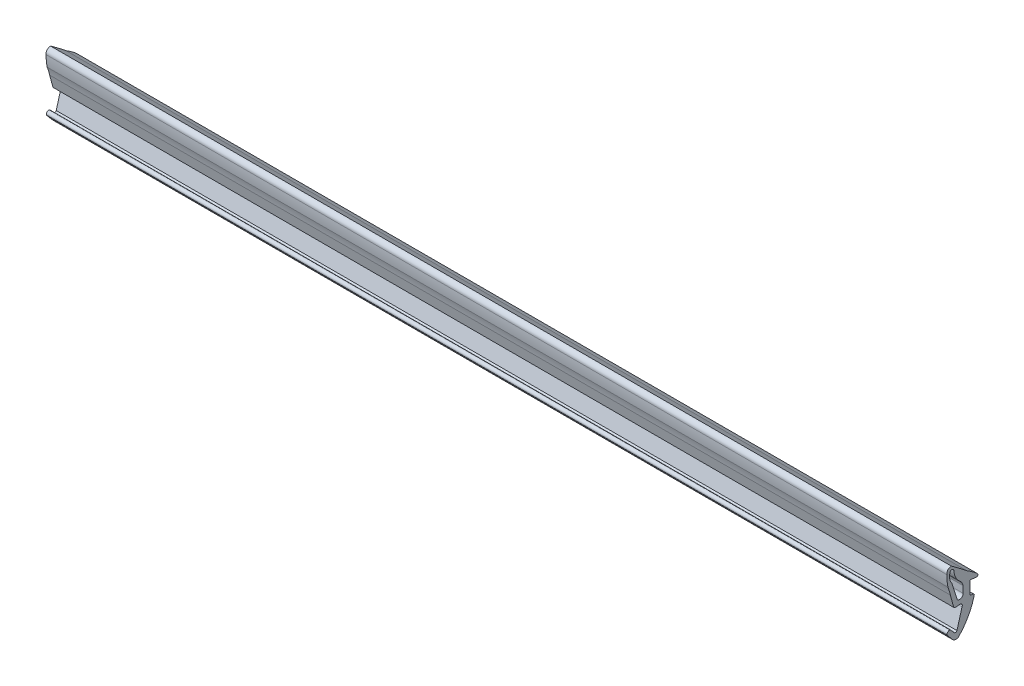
ISO-10303-21;
HEADER;
FILE_DESCRIPTION(('STEP AP214'),'2;1');
FILE_NAME('part.step','',(''),(''),'','','');
FILE_SCHEMA(('AUTOMOTIVE_DESIGN { 1 0 10303 214 1 1 1 1 }'));
ENDSEC;
DATA;
#1=APPLICATION_CONTEXT('core data for automotive mechanical design processes');
#2=APPLICATION_PROTOCOL_DEFINITION('international standard','automotive_design',2000,#1);
#3=PRODUCT_CONTEXT('',#1,'mechanical');
#4=PRODUCT('Part','Part','',(#3));
#5=PRODUCT_RELATED_PRODUCT_CATEGORY('part','',(#4));
#6=PRODUCT_DEFINITION_FORMATION('','',#4);
#7=PRODUCT_DEFINITION_CONTEXT('part definition',#1,'design');
#8=PRODUCT_DEFINITION('design','',#6,#7);
#9=PRODUCT_DEFINITION_SHAPE('','',#8);
#10=(LENGTH_UNIT() NAMED_UNIT(*) SI_UNIT(.MILLI.,.METRE.));
#11=(NAMED_UNIT(*) PLANE_ANGLE_UNIT() SI_UNIT($,.RADIAN.));
#12=(NAMED_UNIT(*) SI_UNIT($,.STERADIAN.) SOLID_ANGLE_UNIT());
#13=UNCERTAINTY_MEASURE_WITH_UNIT(LENGTH_MEASURE(1.E-05),#10,'distance_accuracy_value','');
#14=(GEOMETRIC_REPRESENTATION_CONTEXT(3) GLOBAL_UNCERTAINTY_ASSIGNED_CONTEXT((#13)) GLOBAL_UNIT_ASSIGNED_CONTEXT((#10,
#11,#12)) REPRESENTATION_CONTEXT('',''));
#15=CARTESIAN_POINT('',(0.,0.,0.));
#16=DIRECTION('',(0.,0.,1.));
#17=DIRECTION('',(1.,0.,0.));
#18=AXIS2_PLACEMENT_3D('',#15,#16,#17);
#19=CARTESIAN_POINT('',(200.,-53.1995045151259,45.855950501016));
#20=DIRECTION('',(-1.,0.,0.));
#21=DIRECTION('',(0.,0.,1.));
#22=AXIS2_PLACEMENT_3D('',#19,#20,#21);
#23=CYLINDRICAL_SURFACE('',#22,74.8320819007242);
#24=CARTESIAN_POINT('',(0.,-53.1995045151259,45.855950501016));
#25=DIRECTION('',(1.,0.,0.));
#26=DIRECTION('',(0.,0.,-1.));
#27=AXIS2_PLACEMENT_3D('',#24,#25,#26);
#28=CIRCLE('',#27,74.8320819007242);
#29=CARTESIAN_POINT('',(0.,5.13012386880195,-1.02149539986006));
#30=VERTEX_POINT('',#29);
#31=CARTESIAN_POINT('',(0.,7.75606842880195,2.44790276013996));
#32=VERTEX_POINT('',#31);
#33=EDGE_CURVE('E412',#30,#32,#28,.T.);
#34=ORIENTED_EDGE('',*,*,#33,.T.);
#35=DIRECTION('',(-1.,0.,0.));
#36=VECTOR('',#35,1.);
#37=CARTESIAN_POINT('',(200.,7.75606842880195,2.44790276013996));
#38=LINE('',#37,#36);
#39=CARTESIAN_POINT('',(200.,7.75606842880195,2.44790276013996));
#40=VERTEX_POINT('',#39);
#41=EDGE_CURVE('E12',#40,#32,#38,.T.);
#42=ORIENTED_EDGE('',*,*,#41,.F.);
#43=CARTESIAN_POINT('',(200.,-53.1995045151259,45.855950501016));
#44=DIRECTION('',(1.,0.,0.));
#45=DIRECTION('',(0.,0.,-1.));
#46=AXIS2_PLACEMENT_3D('',#43,#44,#45);
#47=CIRCLE('',#46,74.8320819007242);
#48=CARTESIAN_POINT('',(200.,5.13012386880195,-1.02149539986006));
#49=VERTEX_POINT('',#48);
#50=EDGE_CURVE('E637',#49,#40,#47,.T.);
#51=ORIENTED_EDGE('',*,*,#50,.F.);
#52=DIRECTION('',(-1.,0.,0.));
#53=VECTOR('',#52,1.);
#54=CARTESIAN_POINT('',(200.,5.13012386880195,-1.02149539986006));
#55=LINE('',#54,#53);
#56=EDGE_CURVE('E483',#49,#30,#55,.T.);
#57=ORIENTED_EDGE('',*,*,#56,.T.);
#58=EDGE_LOOP('',(#34,#42,#51,#57));
#59=FACE_BOUND('',#58,.T.);
#60=ADVANCED_FACE('F121',(#59),#23,.T.);
#61=CARTESIAN_POINT('',(200.,6.75630640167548,2.46971709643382));
#62=DIRECTION('',(-1.,0.,0.));
#63=DIRECTION('',(0.,0.,1.));
#64=AXIS2_PLACEMENT_3D('',#61,#62,#63);
#65=CYLINDRICAL_SURFACE('',#64,0.999999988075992);
#66=CARTESIAN_POINT('',(0.,6.75630640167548,2.46971709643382));
#67=DIRECTION('',(1.,0.,0.));
#68=DIRECTION('',(0.,0.,-1.));
#69=AXIS2_PLACEMENT_3D('',#66,#67,#68);
#70=CIRCLE('',#69,0.999999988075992);
#71=CARTESIAN_POINT('',(0.,6.61567283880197,3.45977880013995));
#72=VERTEX_POINT('',#71);
#73=EDGE_CURVE('E416',#32,#72,#70,.T.);
#74=ORIENTED_EDGE('',*,*,#73,.T.);
#75=DIRECTION('',(-1.,0.,0.));
#76=VECTOR('',#75,1.);
#77=CARTESIAN_POINT('',(200.,6.61567283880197,3.45977880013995));
#78=LINE('',#77,#76);
#79=CARTESIAN_POINT('',(200.,6.61567283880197,3.45977880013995));
#80=VERTEX_POINT('',#79);
#81=EDGE_CURVE('E132',#80,#72,#78,.T.);
#82=ORIENTED_EDGE('',*,*,#81,.F.);
#83=CARTESIAN_POINT('',(200.,6.75630640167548,2.46971709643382));
#84=DIRECTION('',(1.,0.,0.));
#85=DIRECTION('',(0.,0.,-1.));
#86=AXIS2_PLACEMENT_3D('',#83,#84,#85);
#87=CIRCLE('',#86,0.999999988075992);
#88=EDGE_CURVE('E640',#40,#80,#87,.T.);
#89=ORIENTED_EDGE('',*,*,#88,.F.);
#90=ORIENTED_EDGE('',*,*,#41,.T.);
#91=EDGE_LOOP('',(#74,#82,#89,#90));
#92=FACE_BOUND('',#91,.T.);
#93=ADVANCED_FACE('F727',(#92),#65,.T.);
#94=CARTESIAN_POINT('',(200.,6.71107271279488,-10.484433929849));
#95=DIRECTION('',(-1.,0.,0.));
#96=DIRECTION('',(0.,0.,1.));
#97=AXIS2_PLACEMENT_3D('',#94,#95,#96);
#98=CYLINDRICAL_SURFACE('',#97,13.9445390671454);
#99=CARTESIAN_POINT('',(0.,6.71107271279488,-10.484433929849));
#100=DIRECTION('',(1.,0.,0.));
#101=DIRECTION('',(0.,0.,-1.));
#102=AXIS2_PLACEMENT_3D('',#99,#100,#101);
#103=CIRCLE('',#102,13.9445390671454);
#104=CARTESIAN_POINT('',(0.,4.08842088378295,3.21125397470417));
#105=VERTEX_POINT('',#104);
#106=EDGE_CURVE('E419',#72,#105,#103,.T.);
#107=ORIENTED_EDGE('',*,*,#106,.T.);
#108=DIRECTION('',(-1.,0.,0.));
#109=VECTOR('',#108,1.);
#110=CARTESIAN_POINT('',(200.,4.08842088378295,3.21125397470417));
#111=LINE('',#110,#109);
#112=CARTESIAN_POINT('',(200.,4.08842088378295,3.21125397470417));
#113=VERTEX_POINT('',#112);
#114=EDGE_CURVE('E558',#113,#105,#111,.T.);
#115=ORIENTED_EDGE('',*,*,#114,.F.);
#116=CARTESIAN_POINT('',(200.,6.71107271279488,-10.484433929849));
#117=DIRECTION('',(1.,0.,0.));
#118=DIRECTION('',(0.,0.,-1.));
#119=AXIS2_PLACEMENT_3D('',#116,#117,#118);
#120=CIRCLE('',#119,13.9445390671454);
#121=EDGE_CURVE('E643',#80,#113,#120,.T.);
#122=ORIENTED_EDGE('',*,*,#121,.F.);
#123=ORIENTED_EDGE('',*,*,#81,.T.);
#124=EDGE_LOOP('',(#107,#115,#122,#123));
#125=FACE_BOUND('',#124,.T.);
#126=ADVANCED_FACE('F732',(#125),#98,.T.);
#127=CARTESIAN_POINT('',(200.,-0.662443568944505,15.6826632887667));
#128=DIRECTION('',(-1.,0.,0.));
#129=DIRECTION('',(0.,0.,1.));
#130=AXIS2_PLACEMENT_3D('',#127,#128,#129);
#131=CYLINDRICAL_SURFACE('',#130,13.3456645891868);
#132=CARTESIAN_POINT('',(0.,-0.662443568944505,15.6826632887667));
#133=DIRECTION('',(-1.,0.,0.));
#134=DIRECTION('',(0.,0.,-1.));
#135=AXIS2_PLACEMENT_3D('',#132,#133,#134);
#136=CIRCLE('',#135,13.3456645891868);
#137=CARTESIAN_POINT('',(0.,2.28806195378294,2.66723857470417));
#138=VERTEX_POINT('',#137);
#139=EDGE_CURVE('E422',#105,#138,#136,.T.);
#140=ORIENTED_EDGE('',*,*,#139,.T.);
#141=DIRECTION('',(-1.,0.,0.));
#142=VECTOR('',#141,1.);
#143=CARTESIAN_POINT('',(200.,2.28806195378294,2.66723857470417));
#144=LINE('',#143,#142);
#145=CARTESIAN_POINT('',(200.,2.28806195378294,2.66723857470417));
#146=VERTEX_POINT('',#145);
#147=EDGE_CURVE('E554',#146,#138,#144,.T.);
#148=ORIENTED_EDGE('',*,*,#147,.F.);
#149=CARTESIAN_POINT('',(200.,-0.662443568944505,15.6826632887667));
#150=DIRECTION('',(-1.,0.,0.));
#151=DIRECTION('',(0.,0.,-1.));
#152=AXIS2_PLACEMENT_3D('',#149,#150,#151);
#153=CIRCLE('',#152,13.3456645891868);
#154=EDGE_CURVE('E646',#113,#146,#153,.T.);
#155=ORIENTED_EDGE('',*,*,#154,.F.);
#156=ORIENTED_EDGE('',*,*,#114,.T.);
#157=EDGE_LOOP('',(#140,#148,#155,#156));
#158=FACE_BOUND('',#157,.T.);
#159=ADVANCED_FACE('F830',(#158),#131,.F.);
#160=CARTESIAN_POINT('',(200.,2.28806195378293,2.66723857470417));
#161=DIRECTION('',(0.,0.263639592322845,-0.964621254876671));
#162=DIRECTION('',(0.,0.964621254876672,0.263639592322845));
#163=AXIS2_PLACEMENT_3D('',#160,#161,#162);
#164=PLANE('',#163);
#165=DIRECTION('',(0.,-0.964621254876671,-0.263639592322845));
#166=VECTOR('',#165,1.);
#167=CARTESIAN_POINT('',(0.,2.28806195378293,2.66723857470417));
#168=LINE('',#167,#166);
#169=CARTESIAN_POINT('',(0.,-0.450346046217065,1.91880724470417));
#170=VERTEX_POINT('',#169);
#171=EDGE_CURVE('E425',#138,#170,#168,.T.);
#172=ORIENTED_EDGE('',*,*,#171,.T.);
#173=DIRECTION('',(-1.,0.,0.));
#174=VECTOR('',#173,1.);
#175=CARTESIAN_POINT('',(200.,-0.450346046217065,1.91880724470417));
#176=LINE('',#175,#174);
#177=CARTESIAN_POINT('',(200.,-0.450346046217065,1.91880724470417));
#178=VERTEX_POINT('',#177);
#179=EDGE_CURVE('E550',#178,#170,#176,.T.);
#180=ORIENTED_EDGE('',*,*,#179,.F.);
#181=DIRECTION('',(0.,-0.964621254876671,-0.263639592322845));
#182=VECTOR('',#181,1.);
#183=CARTESIAN_POINT('',(200.,2.28806195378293,2.66723857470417));
#184=LINE('',#183,#182);
#185=EDGE_CURVE('E649',#146,#178,#184,.T.);
#186=ORIENTED_EDGE('',*,*,#185,.F.);
#187=ORIENTED_EDGE('',*,*,#147,.T.);
#188=EDGE_LOOP('',(#172,#180,#186,#187));
#189=FACE_BOUND('',#188,.T.);
#190=ADVANCED_FACE('F826',(#189),#164,.F.);
#191=CARTESIAN_POINT('',(200.,0.152044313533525,1.39237977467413));
#192=DIRECTION('',(-1.,0.,0.));
#193=DIRECTION('',(0.,0.,1.));
#194=AXIS2_PLACEMENT_3D('',#191,#192,#193);
#195=CYLINDRICAL_SURFACE('',#194,0.800000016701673);
#196=CARTESIAN_POINT('',(0.,0.152044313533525,1.39237977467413));
#197=DIRECTION('',(1.,0.,0.));
#198=DIRECTION('',(0.,0.,-1.));
#199=AXIS2_PLACEMENT_3D('',#196,#197,#198);
#200=CIRCLE('',#199,0.800000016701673);
#201=CARTESIAN_POINT('',(0.,-0.635801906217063,1.25346123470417));
#202=VERTEX_POINT('',#201);
#203=EDGE_CURVE('E428',#170,#202,#200,.T.);
#204=ORIENTED_EDGE('',*,*,#203,.T.);
#205=DIRECTION('',(-1.,0.,0.));
#206=VECTOR('',#205,1.);
#207=CARTESIAN_POINT('',(200.,-0.635801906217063,1.25346123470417));
#208=LINE('',#207,#206);
#209=CARTESIAN_POINT('',(200.,-0.635801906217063,1.25346123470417));
#210=VERTEX_POINT('',#209);
#211=EDGE_CURVE('E546',#210,#202,#208,.T.);
#212=ORIENTED_EDGE('',*,*,#211,.F.);
#213=CARTESIAN_POINT('',(200.,0.152044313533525,1.39237977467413));
#214=DIRECTION('',(1.,0.,0.));
#215=DIRECTION('',(0.,0.,-1.));
#216=AXIS2_PLACEMENT_3D('',#213,#214,#215);
#217=CIRCLE('',#216,0.800000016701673);
#218=EDGE_CURVE('E652',#178,#210,#217,.T.);
#219=ORIENTED_EDGE('',*,*,#218,.F.);
#220=ORIENTED_EDGE('',*,*,#179,.T.);
#221=EDGE_LOOP('',(#204,#212,#219,#220));
#222=FACE_BOUND('',#221,.T.);
#223=ADVANCED_FACE('F822',(#222),#195,.T.);
#224=CARTESIAN_POINT('',(200.,-0.635801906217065,1.25346123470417));
#225=DIRECTION('',(0.,0.98480775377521,0.173648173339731));
#226=DIRECTION('',(0.,-0.173648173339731,0.98480775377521));
#227=AXIS2_PLACEMENT_3D('',#224,#225,#226);
#228=PLANE('',#227);
#229=DIRECTION('',(0.,0.173648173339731,-0.98480775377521));
#230=VECTOR('',#229,1.);
#231=CARTESIAN_POINT('',(0.,-0.635801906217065,1.25346123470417));
#232=LINE('',#231,#230);
#233=CARTESIAN_POINT('',(0.,-0.520941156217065,0.602053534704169));
#234=VERTEX_POINT('',#233);
#235=EDGE_CURVE('E431',#202,#234,#232,.T.);
#236=ORIENTED_EDGE('',*,*,#235,.T.);
#237=DIRECTION('',(-1.,0.,0.));
#238=VECTOR('',#237,1.);
#239=CARTESIAN_POINT('',(200.,-0.520941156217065,0.602053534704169));
#240=LINE('',#239,#238);
#241=CARTESIAN_POINT('',(200.,-0.520941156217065,0.602053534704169));
#242=VERTEX_POINT('',#241);
#243=EDGE_CURVE('E542',#242,#234,#240,.T.);
#244=ORIENTED_EDGE('',*,*,#243,.F.);
#245=DIRECTION('',(0.,0.173648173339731,-0.98480775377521));
#246=VECTOR('',#245,1.);
#247=CARTESIAN_POINT('',(200.,-0.635801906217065,1.25346123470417));
#248=LINE('',#247,#246);
#249=EDGE_CURVE('E655',#210,#242,#248,.T.);
#250=ORIENTED_EDGE('',*,*,#249,.F.);
#251=ORIENTED_EDGE('',*,*,#211,.T.);
#252=EDGE_LOOP('',(#236,#244,#250,#251));
#253=FACE_BOUND('',#252,.T.);
#254=ADVANCED_FACE('F818',(#253),#228,.F.);
#255=CARTESIAN_POINT('',(200.,-1.01334503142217,0.515229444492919));
#256=DIRECTION('',(-1.,0.,0.));
#257=DIRECTION('',(0.,0.,1.));
#258=AXIS2_PLACEMENT_3D('',#255,#256,#257);
#259=CYLINDRICAL_SURFACE('',#258,0.49999999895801);
#260=CARTESIAN_POINT('',(0.,-1.01334503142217,0.515229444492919));
#261=DIRECTION('',(-1.,0.,0.));
#262=DIRECTION('',(0.,0.,-1.));
#263=AXIS2_PLACEMENT_3D('',#260,#261,#262);
#264=CIRCLE('',#263,0.49999999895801);
#265=CARTESIAN_POINT('',(0.,-1.25574984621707,0.0779195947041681));
#266=VERTEX_POINT('',#265);
#267=EDGE_CURVE('E434',#234,#266,#264,.T.);
#268=ORIENTED_EDGE('',*,*,#267,.T.);
#269=DIRECTION('',(-1.,0.,0.));
#270=VECTOR('',#269,1.);
#271=CARTESIAN_POINT('',(200.,-1.25574984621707,0.0779195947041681));
#272=LINE('',#271,#270);
#273=CARTESIAN_POINT('',(200.,-1.25574984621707,0.0779195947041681));
#274=VERTEX_POINT('',#273);
#275=EDGE_CURVE('E538',#274,#266,#272,.T.);
#276=ORIENTED_EDGE('',*,*,#275,.F.);
#277=CARTESIAN_POINT('',(200.,-1.01334503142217,0.515229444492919));
#278=DIRECTION('',(-1.,0.,0.));
#279=DIRECTION('',(0.,0.,-1.));
#280=AXIS2_PLACEMENT_3D('',#277,#278,#279);
#281=CIRCLE('',#280,0.49999999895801);
#282=EDGE_CURVE('E658',#242,#274,#281,.T.);
#283=ORIENTED_EDGE('',*,*,#282,.F.);
#284=ORIENTED_EDGE('',*,*,#243,.T.);
#285=EDGE_LOOP('',(#268,#276,#283,#284));
#286=FACE_BOUND('',#285,.T.);
#287=ADVANCED_FACE('F814',(#286),#259,.F.);
#288=CARTESIAN_POINT('',(200.,-1.25574984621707,0.077919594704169));
#289=DIRECTION('',(0.,-0.270918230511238,-0.962602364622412));
#290=DIRECTION('',(0.,0.962602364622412,-0.270918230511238));
#291=AXIS2_PLACEMENT_3D('',#288,#289,#290);
#292=PLANE('',#291);
#293=DIRECTION('',(0.,-0.962602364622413,0.270918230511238));
#294=VECTOR('',#293,1.);
#295=CARTESIAN_POINT('',(0.,-1.25574984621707,0.077919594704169));
#296=LINE('',#295,#294);
#297=CARTESIAN_POINT('',(0.,-5.25837802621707,1.20443349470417));
#298=VERTEX_POINT('',#297);
#299=EDGE_CURVE('E437',#266,#298,#296,.T.);
#300=ORIENTED_EDGE('',*,*,#299,.T.);
#301=DIRECTION('',(-1.,0.,0.));
#302=VECTOR('',#301,1.);
#303=CARTESIAN_POINT('',(200.,-5.25837802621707,1.20443349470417));
#304=LINE('',#303,#302);
#305=CARTESIAN_POINT('',(200.,-5.25837802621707,1.20443349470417));
#306=VERTEX_POINT('',#305);
#307=EDGE_CURVE('E534',#306,#298,#304,.T.);
#308=ORIENTED_EDGE('',*,*,#307,.F.);
#309=DIRECTION('',(0.,-0.962602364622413,0.270918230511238));
#310=VECTOR('',#309,1.);
#311=CARTESIAN_POINT('',(200.,-1.25574984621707,0.077919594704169));
#312=LINE('',#311,#310);
#313=EDGE_CURVE('E661',#274,#306,#312,.T.);
#314=ORIENTED_EDGE('',*,*,#313,.F.);
#315=ORIENTED_EDGE('',*,*,#275,.T.);
#316=EDGE_LOOP('',(#300,#308,#314,#315));
#317=FACE_BOUND('',#316,.T.);
#318=ADVANCED_FACE('F810',(#317),#292,.F.);
#319=CARTESIAN_POINT('',(200.,-5.06445419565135,1.55428137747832));
#320=DIRECTION('',(-1.,0.,0.));
#321=DIRECTION('',(0.,0.,1.));
#322=AXIS2_PLACEMENT_3D('',#319,#320,#321);
#323=CYLINDRICAL_SURFACE('',#322,0.39999999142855);
#324=CARTESIAN_POINT('',(0.,-5.06445419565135,1.55428137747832));
#325=DIRECTION('',(-1.,0.,0.));
#326=DIRECTION('',(0.,0.,-1.));
#327=AXIS2_PLACEMENT_3D('',#324,#325,#326);
#328=CIRCLE('',#327,0.39999999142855);
#329=CARTESIAN_POINT('',(0.,-5.32156922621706,1.86069915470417));
#330=VERTEX_POINT('',#329);
#331=EDGE_CURVE('E440',#298,#330,#328,.T.);
#332=ORIENTED_EDGE('',*,*,#331,.T.);
#333=DIRECTION('',(-1.,0.,0.));
#334=VECTOR('',#333,1.);
#335=CARTESIAN_POINT('',(200.,-5.32156922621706,1.86069915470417));
#336=LINE('',#335,#334);
#337=CARTESIAN_POINT('',(200.,-5.32156922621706,1.86069915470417));
#338=VERTEX_POINT('',#337);
#339=EDGE_CURVE('E530',#338,#330,#336,.T.);
#340=ORIENTED_EDGE('',*,*,#339,.F.);
#341=CARTESIAN_POINT('',(200.,-5.06445419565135,1.55428137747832));
#342=DIRECTION('',(-1.,0.,0.));
#343=DIRECTION('',(0.,0.,-1.));
#344=AXIS2_PLACEMENT_3D('',#341,#342,#343);
#345=CIRCLE('',#344,0.39999999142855);
#346=EDGE_CURVE('E664',#306,#338,#345,.T.);
#347=ORIENTED_EDGE('',*,*,#346,.F.);
#348=ORIENTED_EDGE('',*,*,#307,.T.);
#349=EDGE_LOOP('',(#332,#340,#347,#348));
#350=FACE_BOUND('',#349,.T.);
#351=ADVANCED_FACE('F806',(#350),#323,.F.);
#352=CARTESIAN_POINT('',(200.,-5.32156922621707,1.86069915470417));
#353=DIRECTION('',(0.,-0.642787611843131,0.766044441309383));
#354=DIRECTION('',(0.,-0.766044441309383,-0.642787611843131));
#355=AXIS2_PLACEMENT_3D('',#352,#353,#354);
#356=PLANE('',#355);
#357=DIRECTION('',(0.,0.766044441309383,0.642787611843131));
#358=VECTOR('',#357,1.);
#359=CARTESIAN_POINT('',(0.,-5.32156922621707,1.86069915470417));
#360=LINE('',#359,#358);
#361=CARTESIAN_POINT('',(0.,-4.54451063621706,2.51272873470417));
#362=VERTEX_POINT('',#361);
#363=EDGE_CURVE('E443',#330,#362,#360,.T.);
#364=ORIENTED_EDGE('',*,*,#363,.T.);
#365=DIRECTION('',(-1.,0.,0.));
#366=VECTOR('',#365,1.);
#367=CARTESIAN_POINT('',(200.,-4.54451063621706,2.51272873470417));
#368=LINE('',#367,#366);
#369=CARTESIAN_POINT('',(200.,-4.54451063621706,2.51272873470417));
#370=VERTEX_POINT('',#369);
#371=EDGE_CURVE('E526',#370,#362,#368,.T.);
#372=ORIENTED_EDGE('',*,*,#371,.F.);
#373=DIRECTION('',(0.,0.766044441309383,0.642787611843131));
#374=VECTOR('',#373,1.);
#375=CARTESIAN_POINT('',(200.,-5.32156922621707,1.86069915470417));
#376=LINE('',#375,#374);
#377=EDGE_CURVE('E667',#338,#370,#376,.T.);
#378=ORIENTED_EDGE('',*,*,#377,.F.);
#379=ORIENTED_EDGE('',*,*,#339,.T.);
#380=EDGE_LOOP('',(#364,#372,#378,#379));
#381=FACE_BOUND('',#380,.T.);
#382=ADVANCED_FACE('F802',(#381),#356,.F.);
#383=CARTESIAN_POINT('',(200.,-4.86590444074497,2.89575095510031));
#384=DIRECTION('',(-1.,0.,0.));
#385=DIRECTION('',(0.,0.,1.));
#386=AXIS2_PLACEMENT_3D('',#383,#384,#385);
#387=CYLINDRICAL_SURFACE('',#386,0.499999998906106);
#388=CARTESIAN_POINT('',(0.,-4.86590444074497,2.89575095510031));
#389=DIRECTION('',(1.,0.,0.));
#390=DIRECTION('',(0.,0.,-1.));
#391=AXIS2_PLACEMENT_3D('',#388,#389,#390);
#392=CIRCLE('',#391,0.499999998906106);
#393=CARTESIAN_POINT('',(0.,-5.18729824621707,3.27877317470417));
#394=VERTEX_POINT('',#393);
#395=EDGE_CURVE('E446',#362,#394,#392,.T.);
#396=ORIENTED_EDGE('',*,*,#395,.T.);
#397=DIRECTION('',(-1.,0.,0.));
#398=VECTOR('',#397,1.);
#399=CARTESIAN_POINT('',(200.,-5.18729824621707,3.27877317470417));
#400=LINE('',#399,#398);
#401=CARTESIAN_POINT('',(200.,-5.18729824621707,3.27877317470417));
#402=VERTEX_POINT('',#401);
#403=EDGE_CURVE('E522',#402,#394,#400,.T.);
#404=ORIENTED_EDGE('',*,*,#403,.F.);
#405=CARTESIAN_POINT('',(200.,-4.86590444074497,2.89575095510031));
#406=DIRECTION('',(1.,0.,0.));
#407=DIRECTION('',(0.,0.,-1.));
#408=AXIS2_PLACEMENT_3D('',#405,#406,#407);
#409=CIRCLE('',#408,0.499999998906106);
#410=EDGE_CURVE('E670',#370,#402,#409,.T.);
#411=ORIENTED_EDGE('',*,*,#410,.F.);
#412=ORIENTED_EDGE('',*,*,#371,.T.);
#413=EDGE_LOOP('',(#396,#404,#411,#412));
#414=FACE_BOUND('',#413,.T.);
#415=ADVANCED_FACE('F798',(#414),#387,.T.);
#416=CARTESIAN_POINT('',(200.,-5.18729824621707,3.27877317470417));
#417=DIRECTION('',(0.,0.64278761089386,-0.766044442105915));
#418=DIRECTION('',(0.,0.766044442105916,0.64278761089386));
#419=AXIS2_PLACEMENT_3D('',#416,#417,#418);
#420=PLANE('',#419);
#421=DIRECTION('',(0.,-0.766044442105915,-0.64278761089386));
#422=VECTOR('',#421,1.);
#423=CARTESIAN_POINT('',(0.,-5.18729824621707,3.27877317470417));
#424=LINE('',#423,#422);
#425=CARTESIAN_POINT('',(0.,-6.48135757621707,2.19292846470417));
#426=VERTEX_POINT('',#425);
#427=EDGE_CURVE('E449',#394,#426,#424,.T.);
#428=ORIENTED_EDGE('',*,*,#427,.T.);
#429=DIRECTION('',(-1.,0.,0.));
#430=VECTOR('',#429,1.);
#431=CARTESIAN_POINT('',(200.,-6.48135757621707,2.19292846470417));
#432=LINE('',#431,#430);
#433=CARTESIAN_POINT('',(200.,-6.48135757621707,2.19292846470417));
#434=VERTEX_POINT('',#433);
#435=EDGE_CURVE('E518',#434,#426,#432,.T.);
#436=ORIENTED_EDGE('',*,*,#435,.F.);
#437=DIRECTION('',(0.,-0.766044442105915,-0.64278761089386));
#438=VECTOR('',#437,1.);
#439=CARTESIAN_POINT('',(200.,-5.18729824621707,3.27877317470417));
#440=LINE('',#439,#438);
#441=EDGE_CURVE('E673',#402,#434,#440,.T.);
#442=ORIENTED_EDGE('',*,*,#441,.F.);
#443=ORIENTED_EDGE('',*,*,#403,.T.);
#444=EDGE_LOOP('',(#428,#436,#442,#443));
#445=FACE_BOUND('',#444,.T.);
#446=ADVANCED_FACE('F794',(#445),#420,.F.);
#447=CARTESIAN_POINT('',(200.,-5.83856996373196,1.42688402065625));
#448=DIRECTION('',(-1.,0.,0.));
#449=DIRECTION('',(0.,0.,1.));
#450=AXIS2_PLACEMENT_3D('',#447,#448,#449);
#451=CYLINDRICAL_SURFACE('',#450,1.00000000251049);
#452=CARTESIAN_POINT('',(0.,-5.83856996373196,1.42688402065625));
#453=DIRECTION('',(1.,0.,0.));
#454=DIRECTION('',(0.,0.,-1.));
#455=AXIS2_PLACEMENT_3D('',#452,#453,#454);
#456=CIRCLE('',#455,1.00000000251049);
#457=CARTESIAN_POINT('',(0.,-6.62853705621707,0.813734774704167));
#458=VERTEX_POINT('',#457);
#459=EDGE_CURVE('E452',#426,#458,#456,.T.);
#460=ORIENTED_EDGE('',*,*,#459,.T.);
#461=DIRECTION('',(-1.,0.,0.));
#462=VECTOR('',#461,1.);
#463=CARTESIAN_POINT('',(200.,-6.62853705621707,0.813734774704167));
#464=LINE('',#463,#462);
#465=CARTESIAN_POINT('',(200.,-6.62853705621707,0.813734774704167));
#466=VERTEX_POINT('',#465);
#467=EDGE_CURVE('E514',#466,#458,#464,.T.);
#468=ORIENTED_EDGE('',*,*,#467,.F.);
#469=CARTESIAN_POINT('',(200.,-5.83856996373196,1.42688402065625));
#470=DIRECTION('',(1.,0.,0.));
#471=DIRECTION('',(0.,0.,-1.));
#472=AXIS2_PLACEMENT_3D('',#469,#470,#471);
#473=CIRCLE('',#472,1.00000000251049);
#474=EDGE_CURVE('E676',#434,#466,#473,.T.);
#475=ORIENTED_EDGE('',*,*,#474,.F.);
#476=ORIENTED_EDGE('',*,*,#435,.T.);
#477=EDGE_LOOP('',(#460,#468,#475,#476));
#478=FACE_BOUND('',#477,.T.);
#479=ADVANCED_FACE('F790',(#478),#451,.T.);
#480=CARTESIAN_POINT('',(200.,2.93502423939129,10.7488894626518));
#481=DIRECTION('',(-1.,0.,0.));
#482=DIRECTION('',(0.,0.,1.));
#483=AXIS2_PLACEMENT_3D('',#480,#481,#482);
#484=CYLINDRICAL_SURFACE('',#483,13.7901777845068);
#485=CARTESIAN_POINT('',(0.,2.93502423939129,10.7488894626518));
#486=DIRECTION('',(1.,0.,0.));
#487=DIRECTION('',(0.,0.,-1.));
#488=AXIS2_PLACEMENT_3D('',#485,#486,#487);
#489=CIRCLE('',#488,13.7901777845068);
#490=CARTESIAN_POINT('',(0.,-0.449299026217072,-2.61955694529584));
#491=VERTEX_POINT('',#490);
#492=EDGE_CURVE('E455',#458,#491,#489,.T.);
#493=ORIENTED_EDGE('',*,*,#492,.T.);
#494=DIRECTION('',(-1.,0.,0.));
#495=VECTOR('',#494,1.);
#496=CARTESIAN_POINT('',(200.,-0.449299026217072,-2.61955694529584));
#497=LINE('',#496,#495);
#498=CARTESIAN_POINT('',(200.,-0.449299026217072,-2.61955694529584));
#499=VERTEX_POINT('',#498);
#500=EDGE_CURVE('E510',#499,#491,#497,.T.);
#501=ORIENTED_EDGE('',*,*,#500,.F.);
#502=CARTESIAN_POINT('',(200.,2.93502423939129,10.7488894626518));
#503=DIRECTION('',(1.,0.,0.));
#504=DIRECTION('',(0.,0.,-1.));
#505=AXIS2_PLACEMENT_3D('',#502,#503,#504);
#506=CIRCLE('',#505,13.7901777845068);
#507=EDGE_CURVE('E679',#466,#499,#506,.T.);
#508=ORIENTED_EDGE('',*,*,#507,.F.);
#509=ORIENTED_EDGE('',*,*,#467,.T.);
#510=EDGE_LOOP('',(#493,#501,#508,#509));
#511=FACE_BOUND('',#510,.T.);
#512=ADVANCED_FACE('F786',(#511),#484,.T.);
#513=CARTESIAN_POINT('',(200.,-0.337791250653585,-2.34105018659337));
#514=DIRECTION('',(-1.,0.,0.));
#515=DIRECTION('',(0.,0.,1.));
#516=AXIS2_PLACEMENT_3D('',#513,#514,#515);
#517=CYLINDRICAL_SURFACE('',#516,0.29999999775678);
#518=CARTESIAN_POINT('',(0.,-0.337791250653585,-2.34105018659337));
#519=DIRECTION('',(1.,0.,0.));
#520=DIRECTION('',(0.,0.,-1.));
#521=AXIS2_PLACEMENT_3D('',#518,#519,#520);
#522=CIRCLE('',#521,0.29999999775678);
#523=CARTESIAN_POINT('',(0.,-0.0423489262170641,-2.39314463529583));
#524=VERTEX_POINT('',#523);
#525=EDGE_CURVE('E458',#491,#524,#522,.T.);
#526=ORIENTED_EDGE('',*,*,#525,.T.);
#527=DIRECTION('',(-1.,0.,0.));
#528=VECTOR('',#527,1.);
#529=CARTESIAN_POINT('',(200.,-0.0423489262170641,-2.39314463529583));
#530=LINE('',#529,#528);
#531=CARTESIAN_POINT('',(200.,-0.0423489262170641,-2.39314463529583));
#532=VERTEX_POINT('',#531);
#533=EDGE_CURVE('E506',#532,#524,#530,.T.);
#534=ORIENTED_EDGE('',*,*,#533,.F.);
#535=CARTESIAN_POINT('',(200.,-0.337791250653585,-2.34105018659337));
#536=DIRECTION('',(1.,0.,0.));
#537=DIRECTION('',(0.,0.,-1.));
#538=AXIS2_PLACEMENT_3D('',#535,#536,#537);
#539=CIRCLE('',#538,0.29999999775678);
#540=EDGE_CURVE('E682',#499,#532,#539,.T.);
#541=ORIENTED_EDGE('',*,*,#540,.F.);
#542=ORIENTED_EDGE('',*,*,#500,.T.);
#543=EDGE_LOOP('',(#526,#534,#541,#542));
#544=FACE_BOUND('',#543,.T.);
#545=ADVANCED_FACE('F782',(#544),#517,.T.);
#546=CARTESIAN_POINT('',(200.,-0.0423489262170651,-2.39314463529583));
#547=DIRECTION('',(0.,-0.984807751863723,0.173648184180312));
#548=DIRECTION('',(0.,-0.173648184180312,-0.984807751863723));
#549=AXIS2_PLACEMENT_3D('',#546,#547,#548);
#550=PLANE('',#549);
#551=DIRECTION('',(0.,0.173648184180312,0.984807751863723));
#552=VECTOR('',#551,1.);
#553=CARTESIAN_POINT('',(0.,-0.0423489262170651,-2.39314463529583));
#554=LINE('',#553,#552);
#555=CARTESIAN_POINT('',(0.,0.041498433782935,-1.91762264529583));
#556=VERTEX_POINT('',#555);
#557=EDGE_CURVE('E461',#524,#556,#554,.T.);
#558=ORIENTED_EDGE('',*,*,#557,.T.);
#559=DIRECTION('',(-1.,0.,0.));
#560=VECTOR('',#559,1.);
#561=CARTESIAN_POINT('',(200.,0.041498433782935,-1.91762264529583));
#562=LINE('',#561,#560);
#563=CARTESIAN_POINT('',(200.,0.041498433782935,-1.91762264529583));
#564=VERTEX_POINT('',#563);
#565=EDGE_CURVE('E502',#564,#556,#562,.T.);
#566=ORIENTED_EDGE('',*,*,#565,.F.);
#567=DIRECTION('',(0.,0.173648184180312,0.984807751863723));
#568=VECTOR('',#567,1.);
#569=CARTESIAN_POINT('',(200.,-0.0423489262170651,-2.39314463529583));
#570=LINE('',#569,#568);
#571=EDGE_CURVE('E685',#532,#564,#570,.T.);
#572=ORIENTED_EDGE('',*,*,#571,.F.);
#573=ORIENTED_EDGE('',*,*,#533,.T.);
#574=EDGE_LOOP('',(#558,#566,#572,#573));
#575=FACE_BOUND('',#574,.T.);
#576=ADVANCED_FACE('F778',(#575),#550,.F.);
#577=CARTESIAN_POINT('',(200.,0.336940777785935,-1.96971711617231));
#578=DIRECTION('',(-1.,0.,0.));
#579=DIRECTION('',(0.,0.,1.));
#580=AXIS2_PLACEMENT_3D('',#577,#578,#579);
#581=CYLINDRICAL_SURFACE('',#580,0.30000002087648);
#582=CARTESIAN_POINT('',(0.,0.336940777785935,-1.96971711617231));
#583=DIRECTION('',(-1.,0.,0.));
#584=DIRECTION('',(0.,0.,-1.));
#585=AXIS2_PLACEMENT_3D('',#582,#583,#584);
#586=CIRCLE('',#585,0.30000002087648);
#587=CARTESIAN_POINT('',(0.,0.336940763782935,-1.66971709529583));
#588=VERTEX_POINT('',#587);
#589=EDGE_CURVE('E464',#556,#588,#586,.T.);
#590=ORIENTED_EDGE('',*,*,#589,.T.);
#591=DIRECTION('',(-1.,0.,0.));
#592=VECTOR('',#591,1.);
#593=CARTESIAN_POINT('',(200.,0.336940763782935,-1.66971709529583));
#594=LINE('',#593,#592);
#595=CARTESIAN_POINT('',(200.,0.336940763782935,-1.66971709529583));
#596=VERTEX_POINT('',#595);
#597=EDGE_CURVE('E498',#596,#588,#594,.T.);
#598=ORIENTED_EDGE('',*,*,#597,.F.);
#599=CARTESIAN_POINT('',(200.,0.336940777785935,-1.96971711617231));
#600=DIRECTION('',(-1.,0.,0.));
#601=DIRECTION('',(0.,0.,-1.));
#602=AXIS2_PLACEMENT_3D('',#599,#600,#601);
#603=CIRCLE('',#602,0.30000002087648);
#604=EDGE_CURVE('E688',#564,#596,#603,.T.);
#605=ORIENTED_EDGE('',*,*,#604,.F.);
#606=ORIENTED_EDGE('',*,*,#565,.T.);
#607=EDGE_LOOP('',(#590,#598,#605,#606));
#608=FACE_BOUND('',#607,.T.);
#609=ADVANCED_FACE('F774',(#608),#581,.F.);
#610=CARTESIAN_POINT('',(200.,0.336940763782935,-1.66971709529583));
#611=DIRECTION('',(0.,0.,1.));
#612=DIRECTION('',(0.,-1.,0.));
#613=AXIS2_PLACEMENT_3D('',#610,#611,#612);
#614=PLANE('',#613);
#615=DIRECTION('',(0.,1.,0.));
#616=VECTOR('',#615,1.);
#617=CARTESIAN_POINT('',(0.,0.336940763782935,-1.66971709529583));
#618=LINE('',#617,#616);
#619=CARTESIAN_POINT('',(0.,2.78662321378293,-1.66971709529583));
#620=VERTEX_POINT('',#619);
#621=EDGE_CURVE('E467',#588,#620,#618,.T.);
#622=ORIENTED_EDGE('',*,*,#621,.T.);
#623=DIRECTION('',(-1.,0.,0.));
#624=VECTOR('',#623,1.);
#625=CARTESIAN_POINT('',(200.,2.78662321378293,-1.66971709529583));
#626=LINE('',#625,#624);
#627=CARTESIAN_POINT('',(200.,2.78662321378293,-1.66971709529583));
#628=VERTEX_POINT('',#627);
#629=EDGE_CURVE('E494',#628,#620,#626,.T.);
#630=ORIENTED_EDGE('',*,*,#629,.F.);
#631=DIRECTION('',(0.,1.,0.));
#632=VECTOR('',#631,1.);
#633=CARTESIAN_POINT('',(200.,0.336940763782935,-1.66971709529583));
#634=LINE('',#633,#632);
#635=EDGE_CURVE('E691',#596,#628,#634,.T.);
#636=ORIENTED_EDGE('',*,*,#635,.F.);
#637=ORIENTED_EDGE('',*,*,#597,.T.);
#638=EDGE_LOOP('',(#622,#630,#636,#637));
#639=FACE_BOUND('',#638,.T.);
#640=ADVANCED_FACE('F771',(#639),#614,.F.);
#641=CARTESIAN_POINT('',(200.,2.78662321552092,-1.86971708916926));
#642=DIRECTION('',(-1.,0.,0.));
#643=DIRECTION('',(0.,0.,1.));
#644=AXIS2_PLACEMENT_3D('',#641,#642,#643);
#645=CYLINDRICAL_SURFACE('',#644,0.199999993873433);
#646=CARTESIAN_POINT('',(0.,2.78662321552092,-1.86971708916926));
#647=DIRECTION('',(-1.,0.,0.));
#648=DIRECTION('',(0.,0.,-1.));
#649=AXIS2_PLACEMENT_3D('',#646,#647,#648);
#650=CIRCLE('',#649,0.199999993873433);
#651=CARTESIAN_POINT('',(0.,2.98586214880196,-1.88714823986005));
#652=VERTEX_POINT('',#651);
#653=EDGE_CURVE('E470',#620,#652,#650,.T.);
#654=ORIENTED_EDGE('',*,*,#653,.T.);
#655=DIRECTION('',(-1.,0.,0.));
#656=VECTOR('',#655,1.);
#657=CARTESIAN_POINT('',(200.,2.98586214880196,-1.88714823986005));
#658=LINE('',#657,#656);
#659=CARTESIAN_POINT('',(200.,2.98586214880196,-1.88714823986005));
#660=VERTEX_POINT('',#659);
#661=EDGE_CURVE('E490',#660,#652,#658,.T.);
#662=ORIENTED_EDGE('',*,*,#661,.F.);
#663=CARTESIAN_POINT('',(200.,2.78662321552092,-1.86971708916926));
#664=DIRECTION('',(-1.,0.,0.));
#665=DIRECTION('',(0.,0.,-1.));
#666=AXIS2_PLACEMENT_3D('',#663,#664,#665);
#667=CIRCLE('',#666,0.199999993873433);
#668=EDGE_CURVE('E694',#628,#660,#667,.T.);
#669=ORIENTED_EDGE('',*,*,#668,.F.);
#670=ORIENTED_EDGE('',*,*,#629,.T.);
#671=EDGE_LOOP('',(#654,#662,#669,#670));
#672=FACE_BOUND('',#671,.T.);
#673=ADVANCED_FACE('F702',(#672),#645,.F.);
#674=CARTESIAN_POINT('',(200.,2.98586214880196,-1.88714823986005));
#675=DIRECTION('',(0.,0.996194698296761,-0.0871557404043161));
#676=DIRECTION('',(0.,0.0871557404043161,0.996194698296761));
#677=AXIS2_PLACEMENT_3D('',#674,#675,#676);
#678=PLANE('',#677);
#679=DIRECTION('',(0.,-0.0871557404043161,-0.996194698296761));
#680=VECTOR('',#679,1.);
#681=CARTESIAN_POINT('',(0.,2.98586214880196,-1.88714823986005));
#682=LINE('',#681,#680);
#683=CARTESIAN_POINT('',(0.,2.87593945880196,-3.14357036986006));
#684=VERTEX_POINT('',#683);
#685=EDGE_CURVE('E473',#652,#684,#682,.T.);
#686=ORIENTED_EDGE('',*,*,#685,.T.);
#687=DIRECTION('',(-1.,0.,0.));
#688=VECTOR('',#687,1.);
#689=CARTESIAN_POINT('',(200.,2.87593945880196,-3.14357036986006));
#690=LINE('',#689,#688);
#691=CARTESIAN_POINT('',(200.,2.87593945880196,-3.14357036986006));
#692=VERTEX_POINT('',#691);
#693=EDGE_CURVE('E365',#692,#684,#690,.T.);
#694=ORIENTED_EDGE('',*,*,#693,.F.);
#695=DIRECTION('',(0.,-0.0871557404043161,-0.996194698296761));
#696=VECTOR('',#695,1.);
#697=CARTESIAN_POINT('',(200.,2.98586214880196,-1.88714823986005));
#698=LINE('',#697,#696);
#699=EDGE_CURVE('E354',#660,#692,#698,.T.);
#700=ORIENTED_EDGE('',*,*,#699,.F.);
#701=ORIENTED_EDGE('',*,*,#661,.T.);
#702=EDGE_LOOP('',(#686,#694,#700,#701));
#703=FACE_BOUND('',#702,.T.);
#704=ADVANCED_FACE('F706',(#703),#678,.F.);
#705=CARTESIAN_POINT('',(200.,3.17479786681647,-3.16971709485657));
#706=DIRECTION('',(-1.,0.,0.));
#707=DIRECTION('',(0.,0.,1.));
#708=AXIS2_PLACEMENT_3D('',#705,#706,#707);
#709=CYLINDRICAL_SURFACE('',#708,0.299999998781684);
#710=CARTESIAN_POINT('',(0.,3.17479786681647,-3.16971709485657));
#711=DIRECTION('',(1.,0.,0.));
#712=DIRECTION('',(0.,0.,-1.));
#713=AXIS2_PLACEMENT_3D('',#710,#711,#712);
#714=CIRCLE('',#713,0.299999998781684);
#715=CARTESIAN_POINT('',(0.,3.38692989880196,-3.38184912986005));
#716=VERTEX_POINT('',#715);
#717=EDGE_CURVE('E363',#684,#716,#714,.T.);
#718=ORIENTED_EDGE('',*,*,#717,.T.);
#719=DIRECTION('',(-1.,0.,0.));
#720=VECTOR('',#719,1.);
#721=CARTESIAN_POINT('',(200.,3.38692989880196,-3.38184912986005));
#722=LINE('',#721,#720);
#723=CARTESIAN_POINT('',(200.,3.38692989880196,-3.38184912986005));
#724=VERTEX_POINT('',#723);
#725=EDGE_CURVE('E360',#724,#716,#722,.T.);
#726=ORIENTED_EDGE('',*,*,#725,.F.);
#727=CARTESIAN_POINT('',(200.,3.17479786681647,-3.16971709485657));
#728=DIRECTION('',(1.,0.,0.));
#729=DIRECTION('',(0.,0.,-1.));
#730=AXIS2_PLACEMENT_3D('',#727,#728,#729);
#731=CIRCLE('',#730,0.299999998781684);
#732=EDGE_CURVE('E348',#692,#724,#731,.T.);
#733=ORIENTED_EDGE('',*,*,#732,.F.);
#734=ORIENTED_EDGE('',*,*,#693,.T.);
#735=EDGE_LOOP('',(#718,#726,#733,#734));
#736=FACE_BOUND('',#735,.T.);
#737=ADVANCED_FACE('F361',(#736),#709,.T.);
#738=CARTESIAN_POINT('',(200.,3.38692989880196,-3.38184912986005));
#739=DIRECTION('',(0.,-0.707106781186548,0.707106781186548));
#740=DIRECTION('',(0.,-0.707106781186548,-0.707106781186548));
#741=AXIS2_PLACEMENT_3D('',#738,#739,#740);
#742=PLANE('',#741);
#743=DIRECTION('',(0.,0.707106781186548,0.707106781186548));
#744=VECTOR('',#743,1.);
#745=CARTESIAN_POINT('',(0.,3.38692989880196,-3.38184912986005));
#746=LINE('',#745,#744);
#747=CARTESIAN_POINT('',(0.,3.59588329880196,-3.17289572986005));
#748=VERTEX_POINT('',#747);
#749=EDGE_CURVE('E245',#716,#748,#746,.T.);
#750=ORIENTED_EDGE('',*,*,#749,.T.);
#751=DIRECTION('',(-1.,0.,0.));
#752=VECTOR('',#751,1.);
#753=CARTESIAN_POINT('',(200.,3.59588329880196,-3.17289572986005));
#754=LINE('',#753,#752);
#755=CARTESIAN_POINT('',(200.,3.59588329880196,-3.17289572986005));
#756=VERTEX_POINT('',#755);
#757=EDGE_CURVE('E366',#756,#748,#754,.T.);
#758=ORIENTED_EDGE('',*,*,#757,.F.);
#759=DIRECTION('',(0.,0.707106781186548,0.707106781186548));
#760=VECTOR('',#759,1.);
#761=CARTESIAN_POINT('',(200.,3.38692989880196,-3.38184912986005));
#762=LINE('',#761,#760);
#763=EDGE_CURVE('E352',#724,#756,#762,.T.);
#764=ORIENTED_EDGE('',*,*,#763,.F.);
#765=ORIENTED_EDGE('',*,*,#725,.T.);
#766=EDGE_LOOP('',(#750,#758,#764,#765));
#767=FACE_BOUND('',#766,.T.);
#768=ADVANCED_FACE('F368',(#767),#742,.F.);
#769=CARTESIAN_POINT('',(200.,5.94581349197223,0.348136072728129));
#770=DIRECTION('',(-1.,0.,0.));
#771=DIRECTION('',(0.,0.,1.));
#772=AXIS2_PLACEMENT_3D('',#769,#770,#771);
#773=CYLINDRICAL_SURFACE('',#772,2.51017117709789);
#774=CARTESIAN_POINT('',(0.,5.94581349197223,0.348136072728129));
#775=DIRECTION('',(1.,0.,0.));
#776=DIRECTION('',(0.,0.,-1.));
#777=AXIS2_PLACEMENT_3D('',#774,#775,#776);
#778=CIRCLE('',#777,2.51017117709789);
#779=CARTESIAN_POINT('',(0.,6.63208854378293,2.76267244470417));
#780=VERTEX_POINT('',#779);
#781=CARTESIAN_POINT('',(0.,4.39411107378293,2.32125009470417));
#782=VERTEX_POINT('',#781);
#783=EDGE_CURVE('E376',#780,#782,#778,.T.);
#784=ORIENTED_EDGE('',*,*,#783,.F.);
#785=DIRECTION('',(-1.,0.,0.));
#786=VECTOR('',#785,1.);
#787=CARTESIAN_POINT('',(200.,6.63208854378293,2.76267244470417));
#788=LINE('',#787,#786);
#789=CARTESIAN_POINT('',(200.,6.63208854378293,2.76267244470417));
#790=VERTEX_POINT('',#789);
#791=EDGE_CURVE('E125',#790,#780,#788,.T.);
#792=ORIENTED_EDGE('',*,*,#791,.F.);
#793=CARTESIAN_POINT('',(200.,5.94581349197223,0.348136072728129));
#794=DIRECTION('',(1.,0.,0.));
#795=DIRECTION('',(0.,0.,-1.));
#796=AXIS2_PLACEMENT_3D('',#793,#794,#795);
#797=CIRCLE('',#796,2.51017117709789);
#798=CARTESIAN_POINT('',(200.,4.39411107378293,2.32125009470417));
#799=VERTEX_POINT('',#798);
#800=EDGE_CURVE('E482',#790,#799,#797,.T.);
#801=ORIENTED_EDGE('',*,*,#800,.T.);
#802=DIRECTION('',(-1.,0.,0.));
#803=VECTOR('',#802,1.);
#804=CARTESIAN_POINT('',(200.,4.39411107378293,2.32125009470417));
#805=LINE('',#804,#803);
#806=EDGE_CURVE('E372',#799,#782,#805,.T.);
#807=ORIENTED_EDGE('',*,*,#806,.T.);
#808=EDGE_LOOP('',(#784,#792,#801,#807));
#809=FACE_BOUND('',#808,.T.);
#810=ADVANCED_FACE('F123',(#809),#773,.F.);
#811=CARTESIAN_POINT('',(200.,6.65049915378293,2.76290885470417));
#812=DIRECTION('',(0.,0.0128399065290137,-0.999917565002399));
#813=DIRECTION('',(0.,0.999917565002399,0.0128399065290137));
#814=AXIS2_PLACEMENT_3D('',#811,#812,#813);
#815=PLANE('',#814);
#816=DIRECTION('',(0.,-0.999917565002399,-0.0128399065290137));
#817=VECTOR('',#816,1.);
#818=CARTESIAN_POINT('',(0.,6.65049915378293,2.76290885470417));
#819=LINE('',#818,#817);
#820=CARTESIAN_POINT('',(0.,6.65049915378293,2.76290885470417));
#821=VERTEX_POINT('',#820);
#822=EDGE_CURVE('E380',#821,#780,#819,.T.);
#823=ORIENTED_EDGE('',*,*,#822,.F.);
#824=DIRECTION('',(-1.,0.,0.));
#825=VECTOR('',#824,1.);
#826=CARTESIAN_POINT('',(200.,6.65049915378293,2.76290885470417));
#827=LINE('',#826,#825);
#828=CARTESIAN_POINT('',(200.,6.65049915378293,2.76290885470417));
#829=VERTEX_POINT('',#828);
#830=EDGE_CURVE('E584',#829,#821,#827,.T.);
#831=ORIENTED_EDGE('',*,*,#830,.F.);
#832=DIRECTION('',(0.,-0.999917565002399,-0.0128399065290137));
#833=VECTOR('',#832,1.);
#834=CARTESIAN_POINT('',(200.,6.65049915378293,2.76290885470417));
#835=LINE('',#834,#833);
#836=EDGE_CURVE('E595',#829,#790,#835,.T.);
#837=ORIENTED_EDGE('',*,*,#836,.T.);
#838=ORIENTED_EDGE('',*,*,#791,.T.);
#839=EDGE_LOOP('',(#823,#831,#837,#838));
#840=FACE_BOUND('',#839,.T.);
#841=ADVANCED_FACE('F593',(#840),#815,.T.);
#842=CARTESIAN_POINT('',(200.,6.65563509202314,2.36294183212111));
#843=DIRECTION('',(-1.,0.,0.));
#844=DIRECTION('',(0.,0.,1.));
#845=AXIS2_PLACEMENT_3D('',#842,#843,#844);
#846=CYLINDRICAL_SURFACE('',#845,0.39999999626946);
#847=CARTESIAN_POINT('',(0.,6.65563509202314,2.36294183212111));
#848=DIRECTION('',(1.,0.,0.));
#849=DIRECTION('',(0.,0.,-1.));
#850=AXIS2_PLACEMENT_3D('',#847,#848,#849);
#851=CIRCLE('',#850,0.39999999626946);
#852=CARTESIAN_POINT('',(0.,6.84407483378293,2.01010977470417));
#853=VERTEX_POINT('',#852);
#854=EDGE_CURVE('E384',#853,#821,#851,.T.);
#855=ORIENTED_EDGE('',*,*,#854,.F.);
#856=DIRECTION('',(-1.,0.,0.));
#857=VECTOR('',#856,1.);
#858=CARTESIAN_POINT('',(200.,6.84407483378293,2.01010977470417));
#859=LINE('',#858,#857);
#860=CARTESIAN_POINT('',(200.,6.84407483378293,2.01010977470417));
#861=VERTEX_POINT('',#860);
#862=EDGE_CURVE('E582',#861,#853,#859,.T.);
#863=ORIENTED_EDGE('',*,*,#862,.F.);
#864=CARTESIAN_POINT('',(200.,6.65563509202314,2.36294183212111));
#865=DIRECTION('',(1.,0.,0.));
#866=DIRECTION('',(0.,0.,-1.));
#867=AXIS2_PLACEMENT_3D('',#864,#865,#866);
#868=CIRCLE('',#867,0.39999999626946);
#869=EDGE_CURVE('E603',#861,#829,#868,.T.);
#870=ORIENTED_EDGE('',*,*,#869,.T.);
#871=ORIENTED_EDGE('',*,*,#830,.T.);
#872=EDGE_LOOP('',(#855,#863,#870,#871));
#873=FACE_BOUND('',#872,.T.);
#874=ADVANCED_FACE('F601',(#873),#846,.F.);
#875=CARTESIAN_POINT('',(200.,6.98540467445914,1.74548570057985));
#876=DIRECTION('',(-1.,0.,0.));
#877=DIRECTION('',(0.,0.,1.));
#878=AXIS2_PLACEMENT_3D('',#875,#876,#877);
#879=CYLINDRICAL_SURFACE('',#878,0.30000004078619);
#880=CARTESIAN_POINT('',(0.,6.98540467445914,1.74548570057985));
#881=DIRECTION('',(-1.,0.,0.));
#882=DIRECTION('',(0.,0.,-1.));
#883=AXIS2_PLACEMENT_3D('',#880,#881,#882);
#884=CIRCLE('',#883,0.30000004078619);
#885=CARTESIAN_POINT('',(0.,6.72346342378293,1.89172798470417));
#886=VERTEX_POINT('',#885);
#887=EDGE_CURVE('E388',#886,#853,#884,.T.);
#888=ORIENTED_EDGE('',*,*,#887,.F.);
#889=DIRECTION('',(-1.,0.,0.));
#890=VECTOR('',#889,1.);
#891=CARTESIAN_POINT('',(200.,6.72346342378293,1.89172798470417));
#892=LINE('',#891,#890);
#893=CARTESIAN_POINT('',(200.,6.72346342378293,1.89172798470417));
#894=VERTEX_POINT('',#893);
#895=EDGE_CURVE('E579',#894,#886,#892,.T.);
#896=ORIENTED_EDGE('',*,*,#895,.F.);
#897=CARTESIAN_POINT('',(200.,6.98540467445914,1.74548570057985));
#898=DIRECTION('',(-1.,0.,0.));
#899=DIRECTION('',(0.,0.,-1.));
#900=AXIS2_PLACEMENT_3D('',#897,#898,#899);
#901=CIRCLE('',#900,0.30000004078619);
#902=EDGE_CURVE('E609',#894,#861,#901,.T.);
#903=ORIENTED_EDGE('',*,*,#902,.T.);
#904=ORIENTED_EDGE('',*,*,#862,.T.);
#905=EDGE_LOOP('',(#888,#896,#903,#904));
#906=FACE_BOUND('',#905,.T.);
#907=ADVANCED_FACE('F613',(#906),#879,.T.);
#908=CARTESIAN_POINT('',(200.,6.74330091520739,-1.81059194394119));
#909=DIRECTION('',(-1.,0.,0.));
#910=DIRECTION('',(0.,0.,1.));
#911=AXIS2_PLACEMENT_3D('',#908,#909,#910);
#912=CYLINDRICAL_SURFACE('',#911,3.70237307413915);
#913=CARTESIAN_POINT('',(0.,6.74330091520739,-1.81059194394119));
#914=DIRECTION('',(-1.,0.,0.));
#915=DIRECTION('',(0.,0.,-1.));
#916=AXIS2_PLACEMENT_3D('',#913,#914,#915);
#917=CIRCLE('',#916,3.70237307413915);
#918=CARTESIAN_POINT('',(0.,4.01101147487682,0.687839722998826));
#919=VERTEX_POINT('',#918);
#920=EDGE_CURVE('E392',#919,#886,#917,.T.);
#921=ORIENTED_EDGE('',*,*,#920,.F.);
#922=DIRECTION('',(-1.,0.,0.));
#923=VECTOR('',#922,1.);
#924=CARTESIAN_POINT('',(200.,4.01101147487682,0.687839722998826));
#925=LINE('',#924,#923);
#926=CARTESIAN_POINT('',(200.,4.01101147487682,0.687839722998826));
#927=VERTEX_POINT('',#926);
#928=EDGE_CURVE('E576',#927,#919,#925,.T.);
#929=ORIENTED_EDGE('',*,*,#928,.F.);
#930=CARTESIAN_POINT('',(200.,6.74330091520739,-1.81059194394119));
#931=DIRECTION('',(-1.,0.,0.));
#932=DIRECTION('',(0.,0.,-1.));
#933=AXIS2_PLACEMENT_3D('',#930,#931,#932);
#934=CIRCLE('',#933,3.70237307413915);
#935=EDGE_CURVE('E615',#927,#894,#934,.T.);
#936=ORIENTED_EDGE('',*,*,#935,.T.);
#937=ORIENTED_EDGE('',*,*,#895,.T.);
#938=EDGE_LOOP('',(#921,#929,#936,#937));
#939=FACE_BOUND('',#938,.T.);
#940=ADVANCED_FACE('F747',(#939),#912,.T.);
#941=CARTESIAN_POINT('',(200.,2.17779570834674,2.07489546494));
#942=DIRECTION('',(-1.,0.,0.));
#943=DIRECTION('',(0.,0.,1.));
#944=AXIS2_PLACEMENT_3D('',#941,#942,#943);
#945=CYLINDRICAL_SURFACE('',#944,2.29882658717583);
#946=CARTESIAN_POINT('',(0.,2.17779570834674,2.07489546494));
#947=DIRECTION('',(1.,0.,0.));
#948=DIRECTION('',(0.,0.,-1.));
#949=AXIS2_PLACEMENT_3D('',#946,#947,#948);
#950=CIRCLE('',#949,2.29882658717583);
#951=CARTESIAN_POINT('',(0.,2.67410018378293,-0.169717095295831));
#952=VERTEX_POINT('',#951);
#953=EDGE_CURVE('E396',#952,#919,#950,.T.);
#954=ORIENTED_EDGE('',*,*,#953,.F.);
#955=DIRECTION('',(-1.,0.,0.));
#956=VECTOR('',#955,1.);
#957=CARTESIAN_POINT('',(200.,2.67410018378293,-0.169717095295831));
#958=LINE('',#957,#956);
#959=CARTESIAN_POINT('',(200.,2.67410018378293,-0.169717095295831));
#960=VERTEX_POINT('',#959);
#961=EDGE_CURVE('E573',#960,#952,#958,.T.);
#962=ORIENTED_EDGE('',*,*,#961,.F.);
#963=CARTESIAN_POINT('',(200.,2.17779570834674,2.07489546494));
#964=DIRECTION('',(1.,0.,0.));
#965=DIRECTION('',(0.,0.,-1.));
#966=AXIS2_PLACEMENT_3D('',#963,#964,#965);
#967=CIRCLE('',#966,2.29882658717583);
#968=EDGE_CURVE('E618',#960,#927,#967,.T.);
#969=ORIENTED_EDGE('',*,*,#968,.T.);
#970=ORIENTED_EDGE('',*,*,#928,.T.);
#971=EDGE_LOOP('',(#954,#962,#969,#970));
#972=FACE_BOUND('',#971,.T.);
#973=ADVANCED_FACE('F743',(#972),#945,.F.);
#974=CARTESIAN_POINT('',(200.,1.20696181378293,-0.169717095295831));
#975=DIRECTION('',(0.,0.,1.));
#976=DIRECTION('',(1.,0.,0.));
#977=AXIS2_PLACEMENT_3D('',#974,#975,#976);
#978=PLANE('',#977);
#979=DIRECTION('',(0.,1.,0.));
#980=VECTOR('',#979,1.);
#981=CARTESIAN_POINT('',(0.,1.20696181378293,-0.169717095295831));
#982=LINE('',#981,#980);
#983=CARTESIAN_POINT('',(0.,1.20696181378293,-0.169717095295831));
#984=VERTEX_POINT('',#983);
#985=EDGE_CURVE('E400',#984,#952,#982,.T.);
#986=ORIENTED_EDGE('',*,*,#985,.F.);
#987=DIRECTION('',(-1.,0.,0.));
#988=VECTOR('',#987,1.);
#989=CARTESIAN_POINT('',(200.,1.20696181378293,-0.169717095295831));
#990=LINE('',#989,#988);
#991=CARTESIAN_POINT('',(200.,1.20696181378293,-0.169717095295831));
#992=VERTEX_POINT('',#991);
#993=EDGE_CURVE('E570',#992,#984,#990,.T.);
#994=ORIENTED_EDGE('',*,*,#993,.F.);
#995=DIRECTION('',(0.,1.,0.));
#996=VECTOR('',#995,1.);
#997=CARTESIAN_POINT('',(200.,1.20696181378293,-0.169717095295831));
#998=LINE('',#997,#996);
#999=EDGE_CURVE('E625',#992,#960,#998,.T.);
#1000=ORIENTED_EDGE('',*,*,#999,.T.);
#1001=ORIENTED_EDGE('',*,*,#961,.T.);
#1002=EDGE_LOOP('',(#986,#994,#1000,#1001));
#1003=FACE_BOUND('',#1002,.T.);
#1004=ADVANCED_FACE('F739',(#1003),#978,.T.);
#1005=CARTESIAN_POINT('',(200.,1.20696182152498,0.630282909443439));
#1006=DIRECTION('',(-1.,0.,0.));
#1007=DIRECTION('',(0.,0.,1.));
#1008=AXIS2_PLACEMENT_3D('',#1005,#1006,#1007);
#1009=CYLINDRICAL_SURFACE('',#1008,0.800000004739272);
#1010=CARTESIAN_POINT('',(0.,1.20696182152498,0.630282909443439));
#1011=DIRECTION('',(1.,0.,0.));
#1012=DIRECTION('',(0.,0.,-1.));
#1013=AXIS2_PLACEMENT_3D('',#1010,#1011,#1012);
#1014=CIRCLE('',#1013,0.800000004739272);
#1015=CARTESIAN_POINT('',(0.,0.552470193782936,1.09032716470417));
#1016=VERTEX_POINT('',#1015);
#1017=EDGE_CURVE('E404',#1016,#984,#1014,.T.);
#1018=ORIENTED_EDGE('',*,*,#1017,.F.);
#1019=DIRECTION('',(-1.,0.,0.));
#1020=VECTOR('',#1019,1.);
#1021=CARTESIAN_POINT('',(200.,0.552470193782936,1.09032716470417));
#1022=LINE('',#1021,#1020);
#1023=CARTESIAN_POINT('',(200.,0.552470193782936,1.09032716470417));
#1024=VERTEX_POINT('',#1023);
#1025=EDGE_CURVE('E567',#1024,#1016,#1022,.T.);
#1026=ORIENTED_EDGE('',*,*,#1025,.F.);
#1027=CARTESIAN_POINT('',(200.,1.20696182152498,0.630282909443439));
#1028=DIRECTION('',(1.,0.,0.));
#1029=DIRECTION('',(0.,0.,-1.));
#1030=AXIS2_PLACEMENT_3D('',#1027,#1028,#1029);
#1031=CIRCLE('',#1030,0.800000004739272);
#1032=EDGE_CURVE('E629',#1024,#992,#1031,.T.);
#1033=ORIENTED_EDGE('',*,*,#1032,.T.);
#1034=ORIENTED_EDGE('',*,*,#993,.T.);
#1035=EDGE_LOOP('',(#1018,#1026,#1033,#1034));
#1036=FACE_BOUND('',#1035,.T.);
#1037=ADVANCED_FACE('F721',(#1036),#1009,.F.);
#1038=CARTESIAN_POINT('',(200.,4.39411107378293,2.32125009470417));
#1039=DIRECTION('',(0.,0.305135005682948,-0.952309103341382));
#1040=DIRECTION('',(0.,0.952309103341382,0.305135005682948));
#1041=AXIS2_PLACEMENT_3D('',#1038,#1039,#1040);
#1042=PLANE('',#1041);
#1043=DIRECTION('',(0.,-0.952309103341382,-0.305135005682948));
#1044=VECTOR('',#1043,1.);
#1045=CARTESIAN_POINT('',(0.,4.39411107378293,2.32125009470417));
#1046=LINE('',#1045,#1044);
#1047=EDGE_CURVE('E408',#782,#1016,#1046,.T.);
#1048=ORIENTED_EDGE('',*,*,#1047,.F.);
#1049=ORIENTED_EDGE('',*,*,#806,.F.);
#1050=DIRECTION('',(0.,-0.952309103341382,-0.305135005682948));
#1051=VECTOR('',#1050,1.);
#1052=CARTESIAN_POINT('',(200.,4.39411107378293,2.32125009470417));
#1053=LINE('',#1052,#1051);
#1054=EDGE_CURVE('E633',#799,#1024,#1053,.T.);
#1055=ORIENTED_EDGE('',*,*,#1054,.T.);
#1056=ORIENTED_EDGE('',*,*,#1025,.T.);
#1057=EDGE_LOOP('',(#1048,#1049,#1055,#1056));
#1058=FACE_BOUND('',#1057,.T.);
#1059=ADVANCED_FACE('F714',(#1058),#1042,.T.);
#1060=CARTESIAN_POINT('',(200.,-11.8747120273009,9.48250055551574));
#1061=DIRECTION('',(-1.,0.,0.));
#1062=DIRECTION('',(0.,0.,1.));
#1063=AXIS2_PLACEMENT_3D('',#1060,#1061,#1062);
#1064=CYLINDRICAL_SURFACE('',#1063,19.9874554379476);
#1065=CARTESIAN_POINT('',(0.,-11.8747120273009,9.48250055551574));
#1066=DIRECTION('',(1.,0.,0.));
#1067=DIRECTION('',(0.,0.,-1.));
#1068=AXIS2_PLACEMENT_3D('',#1065,#1066,#1067);
#1069=CIRCLE('',#1068,19.9874554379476);
#1070=EDGE_CURVE('E251',#748,#30,#1069,.T.);
#1071=ORIENTED_EDGE('',*,*,#1070,.T.);
#1072=ORIENTED_EDGE('',*,*,#56,.F.);
#1073=CARTESIAN_POINT('',(200.,-11.8747120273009,9.48250055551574));
#1074=DIRECTION('',(1.,0.,0.));
#1075=DIRECTION('',(0.,0.,-1.));
#1076=AXIS2_PLACEMENT_3D('',#1073,#1074,#1075);
#1077=CIRCLE('',#1076,19.9874554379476);
#1078=EDGE_CURVE('E141',#756,#49,#1077,.T.);
#1079=ORIENTED_EDGE('',*,*,#1078,.F.);
#1080=ORIENTED_EDGE('',*,*,#757,.T.);
#1081=EDGE_LOOP('',(#1071,#1072,#1079,#1080));
#1082=FACE_BOUND('',#1081,.T.);
#1083=ADVANCED_FACE('F712',(#1082),#1064,.T.);
#1084=CARTESIAN_POINT('',(200.,-53.1995045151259,45.855950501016));
#1085=DIRECTION('',(1.,0.,0.));
#1086=DIRECTION('',(0.,0.,-1.));
#1087=AXIS2_PLACEMENT_3D('',#1084,#1085,#1086);
#1088=PLANE('',#1087);
#1089=ORIENTED_EDGE('',*,*,#800,.F.);
#1090=ORIENTED_EDGE('',*,*,#836,.F.);
#1091=ORIENTED_EDGE('',*,*,#869,.F.);
#1092=ORIENTED_EDGE('',*,*,#902,.F.);
#1093=ORIENTED_EDGE('',*,*,#935,.F.);
#1094=ORIENTED_EDGE('',*,*,#968,.F.);
#1095=ORIENTED_EDGE('',*,*,#999,.F.);
#1096=ORIENTED_EDGE('',*,*,#1032,.F.);
#1097=ORIENTED_EDGE('',*,*,#1054,.F.);
#1098=EDGE_LOOP('',(#1089,#1090,#1091,#1092,#1093,#1094,#1095,#1096,#1097));
#1099=FACE_BOUND('',#1098,.T.);
#1100=ORIENTED_EDGE('',*,*,#50,.T.);
#1101=ORIENTED_EDGE('',*,*,#88,.T.);
#1102=ORIENTED_EDGE('',*,*,#121,.T.);
#1103=ORIENTED_EDGE('',*,*,#154,.T.);
#1104=ORIENTED_EDGE('',*,*,#185,.T.);
#1105=ORIENTED_EDGE('',*,*,#218,.T.);
#1106=ORIENTED_EDGE('',*,*,#249,.T.);
#1107=ORIENTED_EDGE('',*,*,#282,.T.);
#1108=ORIENTED_EDGE('',*,*,#313,.T.);
#1109=ORIENTED_EDGE('',*,*,#346,.T.);
#1110=ORIENTED_EDGE('',*,*,#377,.T.);
#1111=ORIENTED_EDGE('',*,*,#410,.T.);
#1112=ORIENTED_EDGE('',*,*,#441,.T.);
#1113=ORIENTED_EDGE('',*,*,#474,.T.);
#1114=ORIENTED_EDGE('',*,*,#507,.T.);
#1115=ORIENTED_EDGE('',*,*,#540,.T.);
#1116=ORIENTED_EDGE('',*,*,#571,.T.);
#1117=ORIENTED_EDGE('',*,*,#604,.T.);
#1118=ORIENTED_EDGE('',*,*,#635,.T.);
#1119=ORIENTED_EDGE('',*,*,#668,.T.);
#1120=ORIENTED_EDGE('',*,*,#699,.T.);
#1121=ORIENTED_EDGE('',*,*,#732,.T.);
#1122=ORIENTED_EDGE('',*,*,#763,.T.);
#1123=ORIENTED_EDGE('',*,*,#1078,.T.);
#1124=EDGE_LOOP('',(#1100,#1101,#1102,#1103,#1104,#1105,#1106,#1107,#1108,#1109,#1110,#1111,
#1112,#1113,#1114,#1115,#1116,#1117,#1118,#1119,#1120,#1121,#1122,#1123));
#1125=FACE_BOUND('',#1124,.T.);
#1126=ADVANCED_FACE('F350',(#1099,#1125),#1088,.T.);
#1127=CARTESIAN_POINT('',(0.,-53.1995045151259,45.855950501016));
#1128=DIRECTION('',(1.,0.,0.));
#1129=DIRECTION('',(0.,0.,-1.));
#1130=AXIS2_PLACEMENT_3D('',#1127,#1128,#1129);
#1131=PLANE('',#1130);
#1132=ORIENTED_EDGE('',*,*,#783,.T.);
#1133=ORIENTED_EDGE('',*,*,#1047,.T.);
#1134=ORIENTED_EDGE('',*,*,#1017,.T.);
#1135=ORIENTED_EDGE('',*,*,#985,.T.);
#1136=ORIENTED_EDGE('',*,*,#953,.T.);
#1137=ORIENTED_EDGE('',*,*,#920,.T.);
#1138=ORIENTED_EDGE('',*,*,#887,.T.);
#1139=ORIENTED_EDGE('',*,*,#854,.T.);
#1140=ORIENTED_EDGE('',*,*,#822,.T.);
#1141=EDGE_LOOP('',(#1132,#1133,#1134,#1135,#1136,#1137,#1138,#1139,#1140));
#1142=FACE_BOUND('',#1141,.T.);
#1143=ORIENTED_EDGE('',*,*,#33,.F.);
#1144=ORIENTED_EDGE('',*,*,#1070,.F.);
#1145=ORIENTED_EDGE('',*,*,#749,.F.);
#1146=ORIENTED_EDGE('',*,*,#717,.F.);
#1147=ORIENTED_EDGE('',*,*,#685,.F.);
#1148=ORIENTED_EDGE('',*,*,#653,.F.);
#1149=ORIENTED_EDGE('',*,*,#621,.F.);
#1150=ORIENTED_EDGE('',*,*,#589,.F.);
#1151=ORIENTED_EDGE('',*,*,#557,.F.);
#1152=ORIENTED_EDGE('',*,*,#525,.F.);
#1153=ORIENTED_EDGE('',*,*,#492,.F.);
#1154=ORIENTED_EDGE('',*,*,#459,.F.);
#1155=ORIENTED_EDGE('',*,*,#427,.F.);
#1156=ORIENTED_EDGE('',*,*,#395,.F.);
#1157=ORIENTED_EDGE('',*,*,#363,.F.);
#1158=ORIENTED_EDGE('',*,*,#331,.F.);
#1159=ORIENTED_EDGE('',*,*,#299,.F.);
#1160=ORIENTED_EDGE('',*,*,#267,.F.);
#1161=ORIENTED_EDGE('',*,*,#235,.F.);
#1162=ORIENTED_EDGE('',*,*,#203,.F.);
#1163=ORIENTED_EDGE('',*,*,#171,.F.);
#1164=ORIENTED_EDGE('',*,*,#139,.F.);
#1165=ORIENTED_EDGE('',*,*,#106,.F.);
#1166=ORIENTED_EDGE('',*,*,#73,.F.);
#1167=EDGE_LOOP('',(#1143,#1144,#1145,#1146,#1147,#1148,#1149,#1150,#1151,#1152,#1153,#1154,
#1155,#1156,#1157,#1158,#1159,#1160,#1161,#1162,#1163,#1164,#1165,#1166));
#1168=FACE_BOUND('',#1167,.T.);
#1169=ADVANCED_FACE('F598',(#1142,#1168),#1131,.F.);
#1170=CLOSED_SHELL('',(#60,#93,#126,#159,#190,#223,#254,#287,#318,#351,#382,#415,#446,#479,#512,
#545,#576,#609,#640,#673,#704,#737,#768,#810,#841,#874,#907,#940,#973,#1004,#1037,#1059,#1083,
#1126,#1169));
#1171=MANIFOLD_SOLID_BREP('B2',#1170);
#1172=ADVANCED_BREP_SHAPE_REPRESENTATION('',(#18,#1171),#14);
#1173=SHAPE_DEFINITION_REPRESENTATION(#9,#1172);
ENDSEC;
END-ISO-10303-21;
